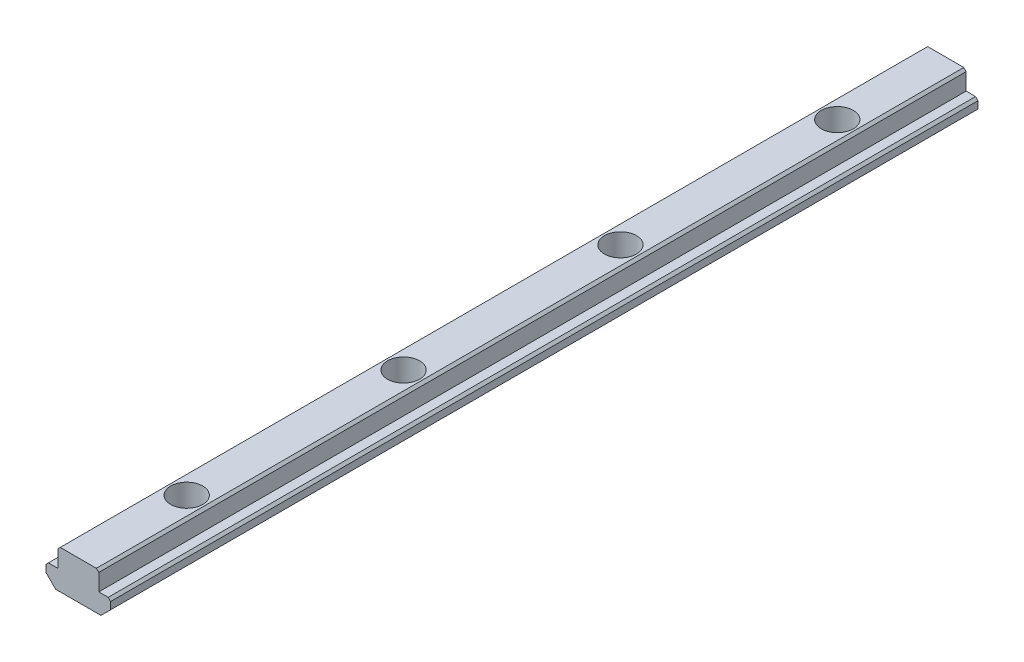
ISO-10303-21;
HEADER;
FILE_DESCRIPTION(('STEP AP214'),'2;1');
FILE_NAME('part.step','',(''),(''),'','','');
FILE_SCHEMA(('AUTOMOTIVE_DESIGN { 1 0 10303 214 1 1 1 1 }'));
ENDSEC;
DATA;
#1=APPLICATION_CONTEXT('core data for automotive mechanical design processes');
#2=APPLICATION_PROTOCOL_DEFINITION('international standard','automotive_design',2000,#1);
#3=PRODUCT_CONTEXT('',#1,'mechanical');
#4=PRODUCT('Part','Part','',(#3));
#5=PRODUCT_RELATED_PRODUCT_CATEGORY('part','',(#4));
#6=PRODUCT_DEFINITION_FORMATION('','',#4);
#7=PRODUCT_DEFINITION_CONTEXT('part definition',#1,'design');
#8=PRODUCT_DEFINITION('design','',#6,#7);
#9=PRODUCT_DEFINITION_SHAPE('','',#8);
#10=(LENGTH_UNIT() NAMED_UNIT(*) SI_UNIT(.MILLI.,.METRE.));
#11=(NAMED_UNIT(*) PLANE_ANGLE_UNIT() SI_UNIT($,.RADIAN.));
#12=(NAMED_UNIT(*) SI_UNIT($,.STERADIAN.) SOLID_ANGLE_UNIT());
#13=UNCERTAINTY_MEASURE_WITH_UNIT(LENGTH_MEASURE(1.E-05),#10,'distance_accuracy_value','');
#14=(GEOMETRIC_REPRESENTATION_CONTEXT(3) GLOBAL_UNCERTAINTY_ASSIGNED_CONTEXT((#13)) GLOBAL_UNIT_ASSIGNED_CONTEXT((#10,
#11,#12)) REPRESENTATION_CONTEXT('',''));
#15=CARTESIAN_POINT('',(0.,0.,0.));
#16=DIRECTION('',(0.,0.,1.));
#17=DIRECTION('',(1.,0.,0.));
#18=AXIS2_PLACEMENT_3D('',#15,#16,#17);
#19=CARTESIAN_POINT('',(-6.7,-0.499999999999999,0.));
#20=DIRECTION('',(-0.707106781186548,0.707106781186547,0.));
#21=DIRECTION('',(-0.707106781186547,-0.707106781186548,0.));
#22=AXIS2_PLACEMENT_3D('',#19,#20,#21);
#23=PLANE('',#22);
#24=DIRECTION('',(-0.707106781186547,-0.707106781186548,0.));
#25=VECTOR('',#24,1.);
#26=CARTESIAN_POINT('',(-6.7,-0.499999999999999,0.));
#27=LINE('',#26,#25);
#28=CARTESIAN_POINT('',(-6.2,0.,0.));
#29=VERTEX_POINT('',#28);
#30=CARTESIAN_POINT('',(-6.7,-0.499999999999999,0.));
#31=VERTEX_POINT('',#30);
#32=EDGE_CURVE('E178',#29,#31,#27,.T.);
#33=ORIENTED_EDGE('',*,*,#32,.T.);
#34=DIRECTION('',(0.,0.,1.));
#35=VECTOR('',#34,1.);
#36=CARTESIAN_POINT('',(-6.7,-0.499999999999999,0.));
#37=LINE('',#36,#35);
#38=CARTESIAN_POINT('',(-6.7,-0.499999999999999,180.));
#39=VERTEX_POINT('',#38);
#40=EDGE_CURVE('E167',#39,#31,#37,.F.);
#41=ORIENTED_EDGE('',*,*,#40,.F.);
#42=DIRECTION('',(-0.707106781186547,-0.707106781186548,0.));
#43=VECTOR('',#42,1.);
#44=CARTESIAN_POINT('',(-6.7,-0.499999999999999,180.));
#45=LINE('',#44,#43);
#46=CARTESIAN_POINT('',(-6.2,0.,180.));
#47=VERTEX_POINT('',#46);
#48=EDGE_CURVE('E181',#39,#47,#45,.F.);
#49=ORIENTED_EDGE('',*,*,#48,.T.);
#50=DIRECTION('',(0.,0.,1.));
#51=VECTOR('',#50,1.);
#52=CARTESIAN_POINT('',(-6.2,0.,0.));
#53=LINE('',#52,#51);
#54=EDGE_CURVE('E162',#29,#47,#53,.T.);
#55=ORIENTED_EDGE('',*,*,#54,.F.);
#56=EDGE_LOOP('',(#33,#41,#49,#55));
#57=FACE_BOUND('',#56,.T.);
#58=ADVANCED_FACE('F15',(#57),#23,.T.);
#59=CARTESIAN_POINT('',(6.2,0.,0.));
#60=DIRECTION('',(0.707106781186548,0.707106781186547,0.));
#61=DIRECTION('',(-0.707106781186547,0.707106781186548,0.));
#62=AXIS2_PLACEMENT_3D('',#59,#60,#61);
#63=PLANE('',#62);
#64=DIRECTION('',(-0.707106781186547,0.707106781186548,0.));
#65=VECTOR('',#64,1.);
#66=CARTESIAN_POINT('',(6.2,0.,0.));
#67=LINE('',#66,#65);
#68=CARTESIAN_POINT('',(6.7,-0.500000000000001,0.));
#69=VERTEX_POINT('',#68);
#70=CARTESIAN_POINT('',(6.2,0.,0.));
#71=VERTEX_POINT('',#70);
#72=EDGE_CURVE('E174',#69,#71,#67,.T.);
#73=ORIENTED_EDGE('',*,*,#72,.T.);
#74=DIRECTION('',(0.,0.,1.));
#75=VECTOR('',#74,1.);
#76=CARTESIAN_POINT('',(6.2,0.,0.));
#77=LINE('',#76,#75);
#78=CARTESIAN_POINT('',(6.2,0.,180.));
#79=VERTEX_POINT('',#78);
#80=EDGE_CURVE('E159',#79,#71,#77,.F.);
#81=ORIENTED_EDGE('',*,*,#80,.F.);
#82=DIRECTION('',(-0.707106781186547,0.707106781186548,0.));
#83=VECTOR('',#82,1.);
#84=CARTESIAN_POINT('',(6.2,0.,180.));
#85=LINE('',#84,#83);
#86=CARTESIAN_POINT('',(6.7,-0.500000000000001,180.));
#87=VERTEX_POINT('',#86);
#88=EDGE_CURVE('E176',#79,#87,#85,.F.);
#89=ORIENTED_EDGE('',*,*,#88,.T.);
#90=DIRECTION('',(0.,0.,-1.));
#91=VECTOR('',#90,1.);
#92=CARTESIAN_POINT('',(6.7,-0.500000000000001,0.));
#93=LINE('',#92,#91);
#94=EDGE_CURVE('E150',#69,#87,#93,.F.);
#95=ORIENTED_EDGE('',*,*,#94,.F.);
#96=EDGE_LOOP('',(#73,#81,#89,#95));
#97=FACE_BOUND('',#96,.T.);
#98=ADVANCED_FACE('F295',(#97),#63,.T.);
#99=CARTESIAN_POINT('',(3.75,4.,0.));
#100=DIRECTION('',(0.707106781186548,0.707106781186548,0.));
#101=DIRECTION('',(-0.707106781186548,0.707106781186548,0.));
#102=AXIS2_PLACEMENT_3D('',#99,#100,#101);
#103=PLANE('',#102);
#104=DIRECTION('',(-0.707106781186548,0.707106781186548,0.));
#105=VECTOR('',#104,1.);
#106=CARTESIAN_POINT('',(3.75,4.,0.));
#107=LINE('',#106,#105);
#108=CARTESIAN_POINT('',(4.25,3.5,0.));
#109=VERTEX_POINT('',#108);
#110=CARTESIAN_POINT('',(3.75,4.,0.));
#111=VERTEX_POINT('',#110);
#112=EDGE_CURVE('E126',#109,#111,#107,.T.);
#113=ORIENTED_EDGE('',*,*,#112,.T.);
#114=DIRECTION('',(0.,0.,1.));
#115=VECTOR('',#114,1.);
#116=CARTESIAN_POINT('',(3.75,4.,0.));
#117=LINE('',#116,#115);
#118=CARTESIAN_POINT('',(3.75,4.,180.));
#119=VERTEX_POINT('',#118);
#120=EDGE_CURVE('E144',#119,#111,#117,.F.);
#121=ORIENTED_EDGE('',*,*,#120,.F.);
#122=DIRECTION('',(-0.707106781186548,0.707106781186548,0.));
#123=VECTOR('',#122,1.);
#124=CARTESIAN_POINT('',(3.75,4.,180.));
#125=LINE('',#124,#123);
#126=CARTESIAN_POINT('',(4.25,3.5,180.));
#127=VERTEX_POINT('',#126);
#128=EDGE_CURVE('E172',#119,#127,#125,.F.);
#129=ORIENTED_EDGE('',*,*,#128,.T.);
#130=DIRECTION('',(0.,0.,-1.));
#131=VECTOR('',#130,1.);
#132=CARTESIAN_POINT('',(4.25,3.5,0.));
#133=LINE('',#132,#131);
#134=EDGE_CURVE('E135',#109,#127,#133,.F.);
#135=ORIENTED_EDGE('',*,*,#134,.F.);
#136=EDGE_LOOP('',(#113,#121,#129,#135));
#137=FACE_BOUND('',#136,.T.);
#138=ADVANCED_FACE('F283',(#137),#103,.T.);
#139=CARTESIAN_POINT('',(-4.24999999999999,3.5,0.));
#140=DIRECTION('',(-0.707106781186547,0.707106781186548,0.));
#141=DIRECTION('',(-0.707106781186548,-0.707106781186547,0.));
#142=AXIS2_PLACEMENT_3D('',#139,#140,#141);
#143=PLANE('',#142);
#144=DIRECTION('',(-0.707106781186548,-0.707106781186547,0.));
#145=VECTOR('',#144,1.);
#146=CARTESIAN_POINT('',(-4.24999999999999,3.5,0.));
#147=LINE('',#146,#145);
#148=CARTESIAN_POINT('',(-3.74999999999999,4.,0.));
#149=VERTEX_POINT('',#148);
#150=CARTESIAN_POINT('',(-4.24999999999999,3.5,0.));
#151=VERTEX_POINT('',#150);
#152=EDGE_CURVE('E125',#149,#151,#147,.T.);
#153=ORIENTED_EDGE('',*,*,#152,.T.);
#154=DIRECTION('',(0.,0.,1.));
#155=VECTOR('',#154,1.);
#156=CARTESIAN_POINT('',(-4.24999999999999,3.5,0.));
#157=LINE('',#156,#155);
#158=CARTESIAN_POINT('',(-4.24999999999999,3.5,180.));
#159=VERTEX_POINT('',#158);
#160=EDGE_CURVE('E129',#159,#151,#157,.F.);
#161=ORIENTED_EDGE('',*,*,#160,.F.);
#162=DIRECTION('',(-0.707106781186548,-0.707106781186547,0.));
#163=VECTOR('',#162,1.);
#164=CARTESIAN_POINT('',(-4.24999999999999,3.5,180.));
#165=LINE('',#164,#163);
#166=CARTESIAN_POINT('',(-3.74999999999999,4.,180.));
#167=VERTEX_POINT('',#166);
#168=EDGE_CURVE('E114',#159,#167,#165,.F.);
#169=ORIENTED_EDGE('',*,*,#168,.T.);
#170=DIRECTION('',(0.,0.,1.));
#171=VECTOR('',#170,1.);
#172=CARTESIAN_POINT('',(-3.74999999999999,4.,0.));
#173=LINE('',#172,#171);
#174=EDGE_CURVE('E140',#149,#167,#173,.T.);
#175=ORIENTED_EDGE('',*,*,#174,.F.);
#176=EDGE_LOOP('',(#153,#161,#169,#175));
#177=FACE_BOUND('',#176,.T.);
#178=ADVANCED_FACE('F130',(#177),#143,.T.);
#179=CARTESIAN_POINT('',(-6.7,-2.,0.));
#180=DIRECTION('',(-1.,0.,0.));
#181=DIRECTION('',(0.,0.,1.));
#182=AXIS2_PLACEMENT_3D('',#179,#180,#181);
#183=PLANE('',#182);
#184=DIRECTION('',(0.,1.,0.));
#185=VECTOR('',#184,1.);
#186=CARTESIAN_POINT('',(-6.7,-2.,0.));
#187=LINE('',#186,#185);
#188=CARTESIAN_POINT('',(-6.7,-2.,0.));
#189=VERTEX_POINT('',#188);
#190=EDGE_CURVE('E165',#31,#189,#187,.F.);
#191=ORIENTED_EDGE('',*,*,#190,.T.);
#192=DIRECTION('',(0.,0.,1.));
#193=VECTOR('',#192,1.);
#194=CARTESIAN_POINT('',(-6.7,-2.,0.));
#195=LINE('',#194,#193);
#196=CARTESIAN_POINT('',(-6.7,-2.,180.));
#197=VERTEX_POINT('',#196);
#198=EDGE_CURVE('E235',#197,#189,#195,.F.);
#199=ORIENTED_EDGE('',*,*,#198,.F.);
#200=DIRECTION('',(0.,1.,0.));
#201=VECTOR('',#200,1.);
#202=CARTESIAN_POINT('',(-6.7,-0.2830784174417,180.));
#203=LINE('',#202,#201);
#204=EDGE_CURVE('E142',#39,#197,#203,.F.);
#205=ORIENTED_EDGE('',*,*,#204,.F.);
#206=ORIENTED_EDGE('',*,*,#40,.T.);
#207=EDGE_LOOP('',(#191,#199,#205,#206));
#208=FACE_BOUND('',#207,.T.);
#209=ADVANCED_FACE('F255',(#208),#183,.T.);
#210=CARTESIAN_POINT('',(-6.2,0.,0.));
#211=DIRECTION('',(0.,1.,0.));
#212=DIRECTION('',(0.,0.,1.));
#213=AXIS2_PLACEMENT_3D('',#210,#211,#212);
#214=PLANE('',#213);
#215=DIRECTION('',(1.,0.,0.));
#216=VECTOR('',#215,1.);
#217=CARTESIAN_POINT('',(0.,0.,0.));
#218=LINE('',#217,#216);
#219=CARTESIAN_POINT('',(-4.24999999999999,0.,0.));
#220=VERTEX_POINT('',#219);
#221=EDGE_CURVE('E232',#220,#29,#218,.F.);
#222=ORIENTED_EDGE('',*,*,#221,.T.);
#223=ORIENTED_EDGE('',*,*,#54,.T.);
#224=DIRECTION('',(1.,0.,0.));
#225=VECTOR('',#224,1.);
#226=CARTESIAN_POINT('',(0.,0.,180.));
#227=LINE('',#226,#225);
#228=CARTESIAN_POINT('',(-4.24999999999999,0.,180.));
#229=VERTEX_POINT('',#228);
#230=EDGE_CURVE('E139',#229,#47,#227,.F.);
#231=ORIENTED_EDGE('',*,*,#230,.F.);
#232=DIRECTION('',(0.,0.,1.));
#233=VECTOR('',#232,1.);
#234=CARTESIAN_POINT('',(-4.24999999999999,0.,0.));
#235=LINE('',#234,#233);
#236=EDGE_CURVE('E134',#220,#229,#235,.T.);
#237=ORIENTED_EDGE('',*,*,#236,.F.);
#238=EDGE_LOOP('',(#222,#223,#231,#237));
#239=FACE_BOUND('',#238,.T.);
#240=ADVANCED_FACE('F277',(#239),#214,.T.);
#241=CARTESIAN_POINT('',(4.25,0.,0.));
#242=DIRECTION('',(0.,1.,0.));
#243=DIRECTION('',(0.,0.,1.));
#244=AXIS2_PLACEMENT_3D('',#241,#242,#243);
#245=PLANE('',#244);
#246=DIRECTION('',(1.,0.,0.));
#247=VECTOR('',#246,1.);
#248=CARTESIAN_POINT('',(0.,0.,0.));
#249=LINE('',#248,#247);
#250=CARTESIAN_POINT('',(4.25,0.,0.));
#251=VERTEX_POINT('',#250);
#252=EDGE_CURVE('E225',#71,#251,#249,.F.);
#253=ORIENTED_EDGE('',*,*,#252,.T.);
#254=DIRECTION('',(0.,0.,-1.));
#255=VECTOR('',#254,1.);
#256=CARTESIAN_POINT('',(4.25,0.,0.));
#257=LINE('',#256,#255);
#258=CARTESIAN_POINT('',(4.25,0.,180.));
#259=VERTEX_POINT('',#258);
#260=EDGE_CURVE('E156',#259,#251,#257,.T.);
#261=ORIENTED_EDGE('',*,*,#260,.F.);
#262=DIRECTION('',(1.,0.,0.));
#263=VECTOR('',#262,1.);
#264=CARTESIAN_POINT('',(0.,0.,180.));
#265=LINE('',#264,#263);
#266=EDGE_CURVE('E245',#79,#259,#265,.F.);
#267=ORIENTED_EDGE('',*,*,#266,.F.);
#268=ORIENTED_EDGE('',*,*,#80,.T.);
#269=EDGE_LOOP('',(#253,#261,#267,#268));
#270=FACE_BOUND('',#269,.T.);
#271=ADVANCED_FACE('F292',(#270),#245,.T.);
#272=CARTESIAN_POINT('',(4.25,3.5,0.));
#273=DIRECTION('',(1.,0.,0.));
#274=DIRECTION('',(0.,0.,-1.));
#275=AXIS2_PLACEMENT_3D('',#272,#273,#274);
#276=PLANE('',#275);
#277=DIRECTION('',(0.,1.,0.));
#278=VECTOR('',#277,1.);
#279=CARTESIAN_POINT('',(4.25,-0.2830784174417,0.));
#280=LINE('',#279,#278);
#281=EDGE_CURVE('E222',#251,#109,#280,.T.);
#282=ORIENTED_EDGE('',*,*,#281,.T.);
#283=ORIENTED_EDGE('',*,*,#134,.T.);
#284=DIRECTION('',(0.,1.,0.));
#285=VECTOR('',#284,1.);
#286=CARTESIAN_POINT('',(4.25,-0.2830784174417,180.));
#287=LINE('',#286,#285);
#288=EDGE_CURVE('E242',#259,#127,#287,.T.);
#289=ORIENTED_EDGE('',*,*,#288,.F.);
#290=ORIENTED_EDGE('',*,*,#260,.T.);
#291=EDGE_LOOP('',(#282,#283,#289,#290));
#292=FACE_BOUND('',#291,.T.);
#293=ADVANCED_FACE('F288',(#292),#276,.T.);
#294=CARTESIAN_POINT('',(-4.24999999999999,0.,0.));
#295=DIRECTION('',(-1.,0.,0.));
#296=DIRECTION('',(0.,0.,1.));
#297=AXIS2_PLACEMENT_3D('',#294,#295,#296);
#298=PLANE('',#297);
#299=DIRECTION('',(0.,1.,0.));
#300=VECTOR('',#299,1.);
#301=CARTESIAN_POINT('',(-4.24999999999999,-0.2830784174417,0.));
#302=LINE('',#301,#300);
#303=EDGE_CURVE('E217',#151,#220,#302,.F.);
#304=ORIENTED_EDGE('',*,*,#303,.T.);
#305=ORIENTED_EDGE('',*,*,#236,.T.);
#306=DIRECTION('',(0.,1.,0.));
#307=VECTOR('',#306,1.);
#308=CARTESIAN_POINT('',(-4.24999999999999,-0.2830784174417,180.));
#309=LINE('',#308,#307);
#310=EDGE_CURVE('E119',#159,#229,#309,.F.);
#311=ORIENTED_EDGE('',*,*,#310,.F.);
#312=ORIENTED_EDGE('',*,*,#160,.T.);
#313=EDGE_LOOP('',(#304,#305,#311,#312));
#314=FACE_BOUND('',#313,.T.);
#315=ADVANCED_FACE('F137',(#314),#298,.T.);
#316=CARTESIAN_POINT('',(6.7,-0.500000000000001,0.));
#317=DIRECTION('',(1.,0.,0.));
#318=DIRECTION('',(0.,0.,-1.));
#319=AXIS2_PLACEMENT_3D('',#316,#317,#318);
#320=PLANE('',#319);
#321=DIRECTION('',(0.,1.,0.));
#322=VECTOR('',#321,1.);
#323=CARTESIAN_POINT('',(6.7,-0.2830784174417,0.));
#324=LINE('',#323,#322);
#325=CARTESIAN_POINT('',(6.7,-2.,0.));
#326=VERTEX_POINT('',#325);
#327=EDGE_CURVE('E227',#326,#69,#324,.T.);
#328=ORIENTED_EDGE('',*,*,#327,.T.);
#329=ORIENTED_EDGE('',*,*,#94,.T.);
#330=DIRECTION('',(0.,1.,0.));
#331=VECTOR('',#330,1.);
#332=CARTESIAN_POINT('',(6.7,-0.2830784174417,180.));
#333=LINE('',#332,#331);
#334=CARTESIAN_POINT('',(6.7,-2.,180.));
#335=VERTEX_POINT('',#334);
#336=EDGE_CURVE('E248',#335,#87,#333,.T.);
#337=ORIENTED_EDGE('',*,*,#336,.F.);
#338=DIRECTION('',(0.,0.,1.));
#339=VECTOR('',#338,1.);
#340=CARTESIAN_POINT('',(6.7,-2.,0.));
#341=LINE('',#340,#339);
#342=EDGE_CURVE('E203',#326,#335,#341,.T.);
#343=ORIENTED_EDGE('',*,*,#342,.F.);
#344=EDGE_LOOP('',(#328,#329,#337,#343));
#345=FACE_BOUND('',#344,.T.);
#346=ADVANCED_FACE('F298',(#345),#320,.T.);
#347=CARTESIAN_POINT('',(-3.74999999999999,4.,0.));
#348=DIRECTION('',(0.,1.,0.));
#349=DIRECTION('',(0.,0.,1.));
#350=AXIS2_PLACEMENT_3D('',#347,#348,#349);
#351=PLANE('',#350);
#352=CARTESIAN_POINT('',(0.,4.,22.5));
#353=DIRECTION('',(0.,-1.,0.));
#354=DIRECTION('',(0.,0.,-1.));
#355=AXIS2_PLACEMENT_3D('',#352,#353,#354);
#356=CIRCLE('',#355,3.3235);
#357=CARTESIAN_POINT('',(0.,4.,19.1765));
#358=VERTEX_POINT('',#357);
#359=EDGE_CURVE('E192',#358,#358,#356,.T.);
#360=ORIENTED_EDGE('',*,*,#359,.T.);
#361=EDGE_LOOP('',(#360));
#362=FACE_BOUND('',#361,.T.);
#363=CARTESIAN_POINT('',(0.,4.,157.5));
#364=DIRECTION('',(0.,-1.,0.));
#365=DIRECTION('',(0.,0.,-1.));
#366=AXIS2_PLACEMENT_3D('',#363,#364,#365);
#367=CIRCLE('',#366,3.32350000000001);
#368=CARTESIAN_POINT('',(0.,4.,154.1765));
#369=VERTEX_POINT('',#368);
#370=EDGE_CURVE('E196',#369,#369,#367,.T.);
#371=ORIENTED_EDGE('',*,*,#370,.T.);
#372=EDGE_LOOP('',(#371));
#373=FACE_BOUND('',#372,.T.);
#374=CARTESIAN_POINT('',(0.,4.,112.5));
#375=DIRECTION('',(0.,-1.,0.));
#376=DIRECTION('',(0.,0.,-1.));
#377=AXIS2_PLACEMENT_3D('',#374,#375,#376);
#378=CIRCLE('',#377,3.3235);
#379=CARTESIAN_POINT('',(0.,4.,109.1765));
#380=VERTEX_POINT('',#379);
#381=EDGE_CURVE('E198',#380,#380,#378,.T.);
#382=ORIENTED_EDGE('',*,*,#381,.T.);
#383=EDGE_LOOP('',(#382));
#384=FACE_BOUND('',#383,.T.);
#385=CARTESIAN_POINT('',(0.,4.,67.5));
#386=DIRECTION('',(0.,-1.,0.));
#387=DIRECTION('',(0.,0.,-1.));
#388=AXIS2_PLACEMENT_3D('',#385,#386,#387);
#389=CIRCLE('',#388,3.3235);
#390=CARTESIAN_POINT('',(0.,4.,64.1765));
#391=VERTEX_POINT('',#390);
#392=EDGE_CURVE('E19',#391,#391,#389,.T.);
#393=ORIENTED_EDGE('',*,*,#392,.T.);
#394=EDGE_LOOP('',(#393));
#395=FACE_BOUND('',#394,.T.);
#396=DIRECTION('',(1.,0.,0.));
#397=VECTOR('',#396,1.);
#398=CARTESIAN_POINT('',(0.,4.,0.));
#399=LINE('',#398,#397);
#400=EDGE_CURVE('E219',#111,#149,#399,.F.);
#401=ORIENTED_EDGE('',*,*,#400,.T.);
#402=ORIENTED_EDGE('',*,*,#174,.T.);
#403=DIRECTION('',(1.,0.,0.));
#404=VECTOR('',#403,1.);
#405=CARTESIAN_POINT('',(0.,4.,180.));
#406=LINE('',#405,#404);
#407=EDGE_CURVE('E121',#119,#167,#406,.F.);
#408=ORIENTED_EDGE('',*,*,#407,.F.);
#409=ORIENTED_EDGE('',*,*,#120,.T.);
#410=EDGE_LOOP('',(#401,#402,#408,#409));
#411=FACE_BOUND('',#410,.T.);
#412=ADVANCED_FACE('F280',(#362,#373,#384,#395,#411),#351,.T.);
#413=CARTESIAN_POINT('',(0.,-0.2830784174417,180.));
#414=DIRECTION('',(0.,0.,1.));
#415=DIRECTION('',(1.,0.,0.));
#416=AXIS2_PLACEMENT_3D('',#413,#414,#415);
#417=PLANE('',#416);
#418=ORIENTED_EDGE('',*,*,#128,.F.);
#419=ORIENTED_EDGE('',*,*,#407,.T.);
#420=ORIENTED_EDGE('',*,*,#168,.F.);
#421=ORIENTED_EDGE('',*,*,#310,.T.);
#422=ORIENTED_EDGE('',*,*,#230,.T.);
#423=ORIENTED_EDGE('',*,*,#48,.F.);
#424=ORIENTED_EDGE('',*,*,#204,.T.);
#425=DIRECTION('',(0.707106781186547,-0.707106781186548,0.));
#426=VECTOR('',#425,1.);
#427=CARTESIAN_POINT('',(-4.7,-4.,180.));
#428=LINE('',#427,#426);
#429=CARTESIAN_POINT('',(-4.7,-4.,180.));
#430=VERTEX_POINT('',#429);
#431=EDGE_CURVE('E238',#430,#197,#428,.F.);
#432=ORIENTED_EDGE('',*,*,#431,.F.);
#433=DIRECTION('',(1.,0.,0.));
#434=VECTOR('',#433,1.);
#435=CARTESIAN_POINT('',(4.7,-4.,180.));
#436=LINE('',#435,#434);
#437=CARTESIAN_POINT('',(4.7,-4.,180.));
#438=VERTEX_POINT('',#437);
#439=EDGE_CURVE('E195',#438,#430,#436,.F.);
#440=ORIENTED_EDGE('',*,*,#439,.F.);
#441=DIRECTION('',(0.707106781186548,0.707106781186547,0.));
#442=VECTOR('',#441,1.);
#443=CARTESIAN_POINT('',(6.7,-2.,180.));
#444=LINE('',#443,#442);
#445=EDGE_CURVE('E211',#335,#438,#444,.F.);
#446=ORIENTED_EDGE('',*,*,#445,.F.);
#447=ORIENTED_EDGE('',*,*,#336,.T.);
#448=ORIENTED_EDGE('',*,*,#88,.F.);
#449=ORIENTED_EDGE('',*,*,#266,.T.);
#450=ORIENTED_EDGE('',*,*,#288,.T.);
#451=EDGE_LOOP('',(#418,#419,#420,#421,#422,#423,#424,#432,#440,#446,#447,#448,#449,#450));
#452=FACE_BOUND('',#451,.T.);
#453=ADVANCED_FACE('F116',(#452),#417,.T.);
#454=CARTESIAN_POINT('',(-4.7,-4.,0.));
#455=DIRECTION('',(-0.707106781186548,-0.707106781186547,0.));
#456=DIRECTION('',(0.707106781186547,-0.707106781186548,0.));
#457=AXIS2_PLACEMENT_3D('',#454,#455,#456);
#458=PLANE('',#457);
#459=DIRECTION('',(0.707106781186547,-0.707106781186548,0.));
#460=VECTOR('',#459,1.);
#461=CARTESIAN_POINT('',(-6.7,-2.,0.));
#462=LINE('',#461,#460);
#463=CARTESIAN_POINT('',(-4.7,-4.,0.));
#464=VERTEX_POINT('',#463);
#465=EDGE_CURVE('E230',#189,#464,#462,.T.);
#466=ORIENTED_EDGE('',*,*,#465,.T.);
#467=DIRECTION('',(0.,0.,-1.));
#468=VECTOR('',#467,1.);
#469=CARTESIAN_POINT('',(-4.7,-4.,0.));
#470=LINE('',#469,#468);
#471=EDGE_CURVE('E261',#430,#464,#470,.T.);
#472=ORIENTED_EDGE('',*,*,#471,.F.);
#473=ORIENTED_EDGE('',*,*,#431,.T.);
#474=ORIENTED_EDGE('',*,*,#198,.T.);
#475=EDGE_LOOP('',(#466,#472,#473,#474));
#476=FACE_BOUND('',#475,.T.);
#477=ADVANCED_FACE('F259',(#476),#458,.T.);
#478=CARTESIAN_POINT('',(0.,-0.2830784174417,0.));
#479=DIRECTION('',(0.,0.,1.));
#480=DIRECTION('',(1.,0.,0.));
#481=AXIS2_PLACEMENT_3D('',#478,#479,#480);
#482=PLANE('',#481);
#483=ORIENTED_EDGE('',*,*,#152,.F.);
#484=ORIENTED_EDGE('',*,*,#400,.F.);
#485=ORIENTED_EDGE('',*,*,#112,.F.);
#486=ORIENTED_EDGE('',*,*,#281,.F.);
#487=ORIENTED_EDGE('',*,*,#252,.F.);
#488=ORIENTED_EDGE('',*,*,#72,.F.);
#489=ORIENTED_EDGE('',*,*,#327,.F.);
#490=DIRECTION('',(0.707106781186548,0.707106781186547,0.));
#491=VECTOR('',#490,1.);
#492=CARTESIAN_POINT('',(6.7,-2.,0.));
#493=LINE('',#492,#491);
#494=CARTESIAN_POINT('',(4.7,-4.,0.));
#495=VERTEX_POINT('',#494);
#496=EDGE_CURVE('E34',#495,#326,#493,.T.);
#497=ORIENTED_EDGE('',*,*,#496,.F.);
#498=DIRECTION('',(1.,0.,0.));
#499=VECTOR('',#498,1.);
#500=CARTESIAN_POINT('',(4.7,-4.,0.));
#501=LINE('',#500,#499);
#502=EDGE_CURVE('E265',#464,#495,#501,.T.);
#503=ORIENTED_EDGE('',*,*,#502,.F.);
#504=ORIENTED_EDGE('',*,*,#465,.F.);
#505=ORIENTED_EDGE('',*,*,#190,.F.);
#506=ORIENTED_EDGE('',*,*,#32,.F.);
#507=ORIENTED_EDGE('',*,*,#221,.F.);
#508=ORIENTED_EDGE('',*,*,#303,.F.);
#509=EDGE_LOOP('',(#483,#484,#485,#486,#487,#488,#489,#497,#503,#504,#505,#506,#507,#508));
#510=FACE_BOUND('',#509,.T.);
#511=ADVANCED_FACE('F272',(#510),#482,.F.);
#512=CARTESIAN_POINT('',(6.7,-2.,0.));
#513=DIRECTION('',(0.707106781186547,-0.707106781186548,0.));
#514=DIRECTION('',(0.707106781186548,0.707106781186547,0.));
#515=AXIS2_PLACEMENT_3D('',#512,#513,#514);
#516=PLANE('',#515);
#517=ORIENTED_EDGE('',*,*,#496,.T.);
#518=ORIENTED_EDGE('',*,*,#342,.T.);
#519=ORIENTED_EDGE('',*,*,#445,.T.);
#520=DIRECTION('',(0.,0.,-1.));
#521=VECTOR('',#520,1.);
#522=CARTESIAN_POINT('',(4.7,-4.,0.));
#523=LINE('',#522,#521);
#524=EDGE_CURVE('E191',#495,#438,#523,.F.);
#525=ORIENTED_EDGE('',*,*,#524,.F.);
#526=EDGE_LOOP('',(#517,#518,#519,#525));
#527=FACE_BOUND('',#526,.T.);
#528=ADVANCED_FACE('F269',(#527),#516,.T.);
#529=CARTESIAN_POINT('',(0.,4.,67.5));
#530=DIRECTION('',(0.,-1.,0.));
#531=DIRECTION('',(0.,0.,-1.));
#532=AXIS2_PLACEMENT_3D('',#529,#530,#531);
#533=CYLINDRICAL_SURFACE('',#532,3.3235);
#534=ORIENTED_EDGE('',*,*,#392,.F.);
#535=EDGE_LOOP('',(#534));
#536=FACE_BOUND('',#535,.T.);
#537=CARTESIAN_POINT('',(0.,-4.,67.5));
#538=DIRECTION('',(0.,-1.,0.));
#539=DIRECTION('',(0.,0.,-1.));
#540=AXIS2_PLACEMENT_3D('',#537,#538,#539);
#541=CIRCLE('',#540,3.3235);
#542=CARTESIAN_POINT('',(0.,-4.,64.1765));
#543=VERTEX_POINT('',#542);
#544=EDGE_CURVE('E188',#543,#543,#541,.F.);
#545=ORIENTED_EDGE('',*,*,#544,.F.);
#546=EDGE_LOOP('',(#545));
#547=FACE_BOUND('',#546,.T.);
#548=ADVANCED_FACE('F321',(#536,#547),#533,.F.);
#549=CARTESIAN_POINT('',(0.,4.,112.5));
#550=DIRECTION('',(0.,-1.,0.));
#551=DIRECTION('',(0.,0.,-1.));
#552=AXIS2_PLACEMENT_3D('',#549,#550,#551);
#553=CYLINDRICAL_SURFACE('',#552,3.3235);
#554=ORIENTED_EDGE('',*,*,#381,.F.);
#555=EDGE_LOOP('',(#554));
#556=FACE_BOUND('',#555,.T.);
#557=CARTESIAN_POINT('',(0.,-4.,112.5));
#558=DIRECTION('',(0.,-1.,0.));
#559=DIRECTION('',(0.,0.,-1.));
#560=AXIS2_PLACEMENT_3D('',#557,#558,#559);
#561=CIRCLE('',#560,3.3235);
#562=CARTESIAN_POINT('',(0.,-4.,109.1765));
#563=VERTEX_POINT('',#562);
#564=EDGE_CURVE('E185',#563,#563,#561,.F.);
#565=ORIENTED_EDGE('',*,*,#564,.F.);
#566=EDGE_LOOP('',(#565));
#567=FACE_BOUND('',#566,.T.);
#568=ADVANCED_FACE('F352',(#556,#567),#553,.F.);
#569=CARTESIAN_POINT('',(0.,4.,157.5));
#570=DIRECTION('',(0.,-1.,0.));
#571=DIRECTION('',(0.,0.,-1.));
#572=AXIS2_PLACEMENT_3D('',#569,#570,#571);
#573=CYLINDRICAL_SURFACE('',#572,3.32350000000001);
#574=ORIENTED_EDGE('',*,*,#370,.F.);
#575=EDGE_LOOP('',(#574));
#576=FACE_BOUND('',#575,.T.);
#577=CARTESIAN_POINT('',(0.,-4.,157.5));
#578=DIRECTION('',(0.,-1.,0.));
#579=DIRECTION('',(0.,0.,-1.));
#580=AXIS2_PLACEMENT_3D('',#577,#578,#579);
#581=CIRCLE('',#580,3.32350000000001);
#582=CARTESIAN_POINT('',(0.,-4.,154.1765));
#583=VERTEX_POINT('',#582);
#584=EDGE_CURVE('E25',#583,#583,#581,.F.);
#585=ORIENTED_EDGE('',*,*,#584,.F.);
#586=EDGE_LOOP('',(#585));
#587=FACE_BOUND('',#586,.T.);
#588=ADVANCED_FACE('F315',(#576,#587),#573,.F.);
#589=CARTESIAN_POINT('',(0.,4.,22.5));
#590=DIRECTION('',(0.,-1.,0.));
#591=DIRECTION('',(0.,0.,-1.));
#592=AXIS2_PLACEMENT_3D('',#589,#590,#591);
#593=CYLINDRICAL_SURFACE('',#592,3.3235);
#594=ORIENTED_EDGE('',*,*,#359,.F.);
#595=EDGE_LOOP('',(#594));
#596=FACE_BOUND('',#595,.T.);
#597=CARTESIAN_POINT('',(0.,-4.,22.5));
#598=DIRECTION('',(0.,-1.,0.));
#599=DIRECTION('',(0.,0.,-1.));
#600=AXIS2_PLACEMENT_3D('',#597,#598,#599);
#601=CIRCLE('',#600,3.3235);
#602=CARTESIAN_POINT('',(0.,-4.,19.1765));
#603=VERTEX_POINT('',#602);
#604=EDGE_CURVE('E10',#603,#603,#601,.F.);
#605=ORIENTED_EDGE('',*,*,#604,.F.);
#606=EDGE_LOOP('',(#605));
#607=FACE_BOUND('',#606,.T.);
#608=ADVANCED_FACE('F17',(#596,#607),#593,.F.);
#609=CARTESIAN_POINT('',(4.7,-4.,0.));
#610=DIRECTION('',(0.,-1.,0.));
#611=DIRECTION('',(0.,0.,-1.));
#612=AXIS2_PLACEMENT_3D('',#609,#610,#611);
#613=PLANE('',#612);
#614=ORIENTED_EDGE('',*,*,#604,.T.);
#615=EDGE_LOOP('',(#614));
#616=FACE_BOUND('',#615,.T.);
#617=ORIENTED_EDGE('',*,*,#584,.T.);
#618=EDGE_LOOP('',(#617));
#619=FACE_BOUND('',#618,.T.);
#620=ORIENTED_EDGE('',*,*,#564,.T.);
#621=EDGE_LOOP('',(#620));
#622=FACE_BOUND('',#621,.T.);
#623=ORIENTED_EDGE('',*,*,#544,.T.);
#624=EDGE_LOOP('',(#623));
#625=FACE_BOUND('',#624,.T.);
#626=ORIENTED_EDGE('',*,*,#502,.T.);
#627=ORIENTED_EDGE('',*,*,#524,.T.);
#628=ORIENTED_EDGE('',*,*,#439,.T.);
#629=ORIENTED_EDGE('',*,*,#471,.T.);
#630=EDGE_LOOP('',(#626,#627,#628,#629));
#631=FACE_BOUND('',#630,.T.);
#632=ADVANCED_FACE('F267',(#616,#619,#622,#625,#631),#613,.T.);
#633=CLOSED_SHELL('',(#58,#98,#138,#178,#209,#240,#271,#293,#315,#346,#412,#453,#477,#511,#528,
#548,#568,#588,#608,#632));
#634=MANIFOLD_SOLID_BREP('B1',#633);
#635=ADVANCED_BREP_SHAPE_REPRESENTATION('',(#18,#634),#14);
#636=SHAPE_DEFINITION_REPRESENTATION(#9,#635);
ENDSEC;
END-ISO-10303-21;
